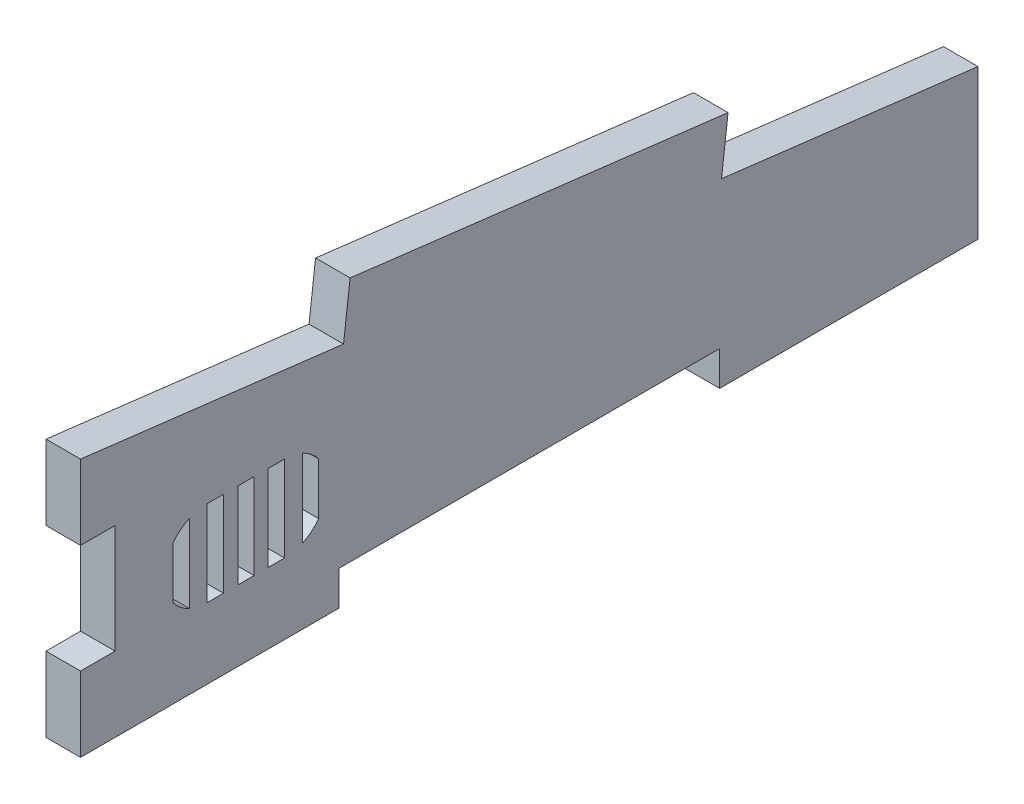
from build123d import *

# Parameters (mm, degrees)
SKETCH1_W           = 3
SKETCH1_H           = 15.759608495
BOSS_EXTRUDE1_DEPTH = 6.35


with BuildPart() as part:
    # Sketch1 → Boss-Extrude1 (new body)
    with BuildSketch(Plane(origin=(0, 0, 0), x_dir=(0, 0, -1), z_dir=(1, 0, 0))):
        Polygon((-127.91381822, -22.333333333), (-127.91381822, -36.083333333), (-121.56381822, -36.083333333), (-121.56381822, -56.083333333), (-127.91381822, -56.083333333), (-127.91381822, -69.833333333), (-80.41381822, -69.833333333), (-80.41381822, -63.483333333), (-10.41381822, -63.483333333), (-10.41381822, -69.833333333), (37.08618178, -69.833333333), (37.08618178, -42.333333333), (-10.068672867, -36.617593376), (-8.865359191, -26.690255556), (-78.356723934, -18.267059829), (-79.560037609, -28.19439765), align=None)
        with Locations((-91.903440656, -48.953529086)):
            Rectangle(SKETCH1_W, SKETCH1_H, mode=Mode.SUBTRACT)
        with Locations((-103.13558036, -48.953529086)):
            Rectangle(SKETCH1_W, SKETCH1_H, mode=Mode.SUBTRACT)
        with BuildLine():
            Line((-110.91381822, -44.191697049), (-110.91381822, -53.715361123))
            ThreePointArc((-110.91381822, -53.715361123), (-109.562645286, -55.102947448), (-107.91381822, -56.119034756))
            Line((-107.91381822, -56.119034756), (-107.91381822, -41.788023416))
            ThreePointArc((-107.91381822, -41.788023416), (-109.562645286, -42.804110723), (-110.91381822, -44.191697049))
        make_face(mode=Mode.SUBTRACT)
        with Locations((-97.503440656, -48.953529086)):
            Rectangle(SKETCH1_W, SKETCH1_H, mode=Mode.SUBTRACT)
        with BuildLine():
            Line((-87.125202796, -41.788023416), (-87.125202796, -56.119034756))
            ThreePointArc((-87.125202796, -56.119034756), (-85.47637573, -55.102947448), (-84.125202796, -53.715361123))
            Line((-84.125202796, -53.715361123), (-84.125202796, -44.191697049))
            ThreePointArc((-84.125202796, -44.191697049), (-85.47637573, -42.804110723), (-87.125202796, -41.788023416))
        make_face(mode=Mode.SUBTRACT)
    extrude(amount=BOSS_EXTRUDE1_DEPTH)


solid = part.part
